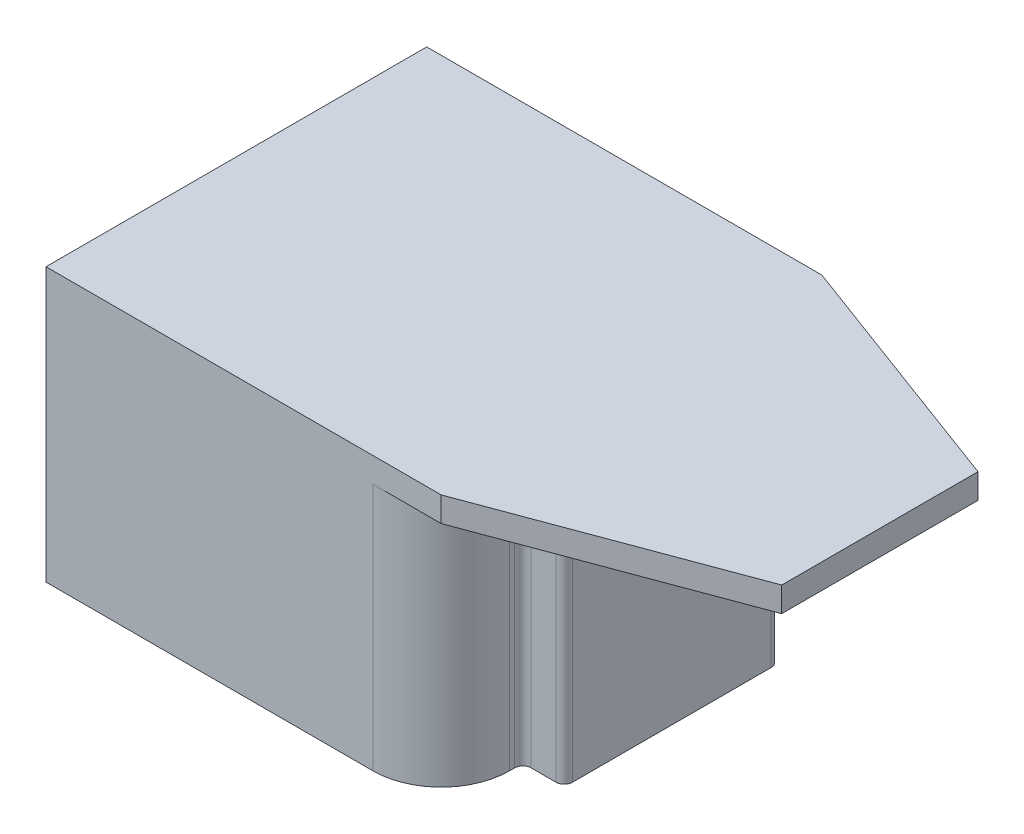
ISO-10303-21;
HEADER;
FILE_DESCRIPTION(('STEP AP214'),'2;1');
FILE_NAME('part.step','',(''),(''),'','','');
FILE_SCHEMA(('AUTOMOTIVE_DESIGN { 1 0 10303 214 1 1 1 1 }'));
ENDSEC;
DATA;
#1=APPLICATION_CONTEXT('core data for automotive mechanical design processes');
#2=APPLICATION_PROTOCOL_DEFINITION('international standard','automotive_design',2000,#1);
#3=PRODUCT_CONTEXT('',#1,'mechanical');
#4=PRODUCT('Part','Part','',(#3));
#5=PRODUCT_RELATED_PRODUCT_CATEGORY('part','',(#4));
#6=PRODUCT_DEFINITION_FORMATION('','',#4);
#7=PRODUCT_DEFINITION_CONTEXT('part definition',#1,'design');
#8=PRODUCT_DEFINITION('design','',#6,#7);
#9=PRODUCT_DEFINITION_SHAPE('','',#8);
#10=(LENGTH_UNIT() NAMED_UNIT(*) SI_UNIT(.MILLI.,.METRE.));
#11=(NAMED_UNIT(*) PLANE_ANGLE_UNIT() SI_UNIT($,.RADIAN.));
#12=(NAMED_UNIT(*) SI_UNIT($,.STERADIAN.) SOLID_ANGLE_UNIT());
#13=UNCERTAINTY_MEASURE_WITH_UNIT(LENGTH_MEASURE(1.E-05),#10,'distance_accuracy_value','');
#14=(GEOMETRIC_REPRESENTATION_CONTEXT(3) GLOBAL_UNCERTAINTY_ASSIGNED_CONTEXT((#13)) GLOBAL_UNIT_ASSIGNED_CONTEXT((#10,
#11,#12)) REPRESENTATION_CONTEXT('',''));
#15=CARTESIAN_POINT('',(0.,0.,0.));
#16=DIRECTION('',(0.,0.,1.));
#17=DIRECTION('',(1.,0.,0.));
#18=AXIS2_PLACEMENT_3D('',#15,#16,#17);
#19=CARTESIAN_POINT('',(63.9999999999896,60.,-23.7301376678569));
#20=DIRECTION('',(0.,-1.,0.));
#21=DIRECTION('',(0.,0.,-1.));
#22=AXIS2_PLACEMENT_3D('',#19,#20,#21);
#23=CYLINDRICAL_SURFACE('',#22,2.);
#24=CARTESIAN_POINT('',(63.9999999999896,0.,-23.730137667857));
#25=DIRECTION('',(0.,1.,0.));
#26=DIRECTION('',(0.,0.,1.));
#27=AXIS2_PLACEMENT_3D('',#24,#25,#26);
#28=CIRCLE('',#27,2.);
#29=CARTESIAN_POINT('',(63.9999999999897,0.,-25.7301376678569));
#30=VERTEX_POINT('',#29);
#31=CARTESIAN_POINT('',(65.9999999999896,0.,-23.730137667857));
#32=VERTEX_POINT('',#31);
#33=EDGE_CURVE('E151',#30,#32,#28,.F.);
#34=ORIENTED_EDGE('',*,*,#33,.F.);
#35=DIRECTION('',(0.,-1.,0.));
#36=VECTOR('',#35,1.);
#37=CARTESIAN_POINT('',(63.9999999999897,60.,-25.7301376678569));
#38=LINE('',#37,#36);
#39=CARTESIAN_POINT('',(63.9999999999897,60.,-25.7301376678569));
#40=VERTEX_POINT('',#39);
#41=EDGE_CURVE('E56',#40,#30,#38,.T.);
#42=ORIENTED_EDGE('',*,*,#41,.F.);
#43=CARTESIAN_POINT('',(63.9999999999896,60.,-23.7301376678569));
#44=DIRECTION('',(0.,1.,0.));
#45=DIRECTION('',(0.,0.,1.));
#46=AXIS2_PLACEMENT_3D('',#43,#44,#45);
#47=CIRCLE('',#46,2.);
#48=CARTESIAN_POINT('',(65.9999999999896,60.,-23.7301376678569));
#49=VERTEX_POINT('',#48);
#50=EDGE_CURVE('E154',#40,#49,#47,.F.);
#51=ORIENTED_EDGE('',*,*,#50,.T.);
#52=DIRECTION('',(0.,-1.,0.));
#53=VECTOR('',#52,1.);
#54=CARTESIAN_POINT('',(65.9999999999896,60.,-23.7301376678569));
#55=LINE('',#54,#53);
#56=EDGE_CURVE('E162',#49,#32,#55,.T.);
#57=ORIENTED_EDGE('',*,*,#56,.T.);
#58=EDGE_LOOP('',(#34,#42,#51,#57));
#59=FACE_BOUND('',#58,.T.);
#60=ADVANCED_FACE('F49',(#59),#23,.T.);
#61=CARTESIAN_POINT('',(0.,60.,-25.7301376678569));
#62=DIRECTION('',(0.,0.,-1.));
#63=DIRECTION('',(-1.,0.,0.));
#64=AXIS2_PLACEMENT_3D('',#61,#62,#63);
#65=PLANE('',#64);
#66=DIRECTION('',(1.,0.,0.));
#67=VECTOR('',#66,1.);
#68=CARTESIAN_POINT('',(0.,0.,-25.730137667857));
#69=LINE('',#68,#67);
#70=CARTESIAN_POINT('',(57.9999999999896,0.,-25.730137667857));
#71=VERTEX_POINT('',#70);
#72=EDGE_CURVE('E242',#71,#30,#69,.T.);
#73=ORIENTED_EDGE('',*,*,#72,.F.);
#74=DIRECTION('',(0.,-1.,0.));
#75=VECTOR('',#74,1.);
#76=CARTESIAN_POINT('',(57.9999999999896,60.,-25.7301376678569));
#77=LINE('',#76,#75);
#78=CARTESIAN_POINT('',(57.9999999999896,60.,-25.7301376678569));
#79=VERTEX_POINT('',#78);
#80=EDGE_CURVE('E233',#79,#71,#77,.T.);
#81=ORIENTED_EDGE('',*,*,#80,.F.);
#82=DIRECTION('',(1.,0.,0.));
#83=VECTOR('',#82,1.);
#84=CARTESIAN_POINT('',(0.,60.,-25.7301376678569));
#85=LINE('',#84,#83);
#86=EDGE_CURVE('E245',#79,#40,#85,.T.);
#87=ORIENTED_EDGE('',*,*,#86,.T.);
#88=ORIENTED_EDGE('',*,*,#41,.T.);
#89=EDGE_LOOP('',(#73,#81,#87,#88));
#90=FACE_BOUND('',#89,.T.);
#91=ADVANCED_FACE('F240',(#90),#65,.T.);
#92=CARTESIAN_POINT('',(57.9999999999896,60.,-27.7301376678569));
#93=DIRECTION('',(0.,-1.,0.));
#94=DIRECTION('',(0.,0.,-1.));
#95=AXIS2_PLACEMENT_3D('',#92,#93,#94);
#96=CYLINDRICAL_SURFACE('',#95,2.);
#97=CARTESIAN_POINT('',(57.9999999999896,0.,-27.730137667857));
#98=DIRECTION('',(0.,1.,0.));
#99=DIRECTION('',(0.,0.,1.));
#100=AXIS2_PLACEMENT_3D('',#97,#98,#99);
#101=CIRCLE('',#100,2.);
#102=CARTESIAN_POINT('',(55.9999999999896,0.,-27.730137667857));
#103=VERTEX_POINT('',#102);
#104=EDGE_CURVE('E251',#71,#103,#101,.F.);
#105=ORIENTED_EDGE('',*,*,#104,.T.);
#106=DIRECTION('',(0.,-1.,0.));
#107=VECTOR('',#106,1.);
#108=CARTESIAN_POINT('',(55.9999999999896,60.,-27.7301376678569));
#109=LINE('',#108,#107);
#110=CARTESIAN_POINT('',(55.9999999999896,60.,-27.7301376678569));
#111=VERTEX_POINT('',#110);
#112=EDGE_CURVE('E230',#111,#103,#109,.T.);
#113=ORIENTED_EDGE('',*,*,#112,.F.);
#114=CARTESIAN_POINT('',(57.9999999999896,60.,-27.7301376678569));
#115=DIRECTION('',(0.,1.,0.));
#116=DIRECTION('',(0.,0.,1.));
#117=AXIS2_PLACEMENT_3D('',#114,#115,#116);
#118=CIRCLE('',#117,2.);
#119=EDGE_CURVE('E519',#79,#111,#118,.F.);
#120=ORIENTED_EDGE('',*,*,#119,.F.);
#121=ORIENTED_EDGE('',*,*,#80,.T.);
#122=EDGE_LOOP('',(#105,#113,#120,#121));
#123=FACE_BOUND('',#122,.T.);
#124=ADVANCED_FACE('F584',(#123),#96,.F.);
#125=CARTESIAN_POINT('',(55.9999999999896,60.,0.));
#126=DIRECTION('',(1.,0.,0.));
#127=DIRECTION('',(0.,0.,-1.));
#128=AXIS2_PLACEMENT_3D('',#125,#126,#127);
#129=PLANE('',#128);
#130=DIRECTION('',(0.,0.,1.));
#131=VECTOR('',#130,1.);
#132=CARTESIAN_POINT('',(55.9999999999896,0.,0.));
#133=LINE('',#132,#131);
#134=CARTESIAN_POINT('',(55.9999999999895,0.,-28.823337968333));
#135=VERTEX_POINT('',#134);
#136=EDGE_CURVE('E261',#135,#103,#133,.T.);
#137=ORIENTED_EDGE('',*,*,#136,.F.);
#138=DIRECTION('',(0.,-1.,0.));
#139=VECTOR('',#138,1.);
#140=CARTESIAN_POINT('',(55.9999999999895,60.,-28.823337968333));
#141=LINE('',#140,#139);
#142=CARTESIAN_POINT('',(55.9999999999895,60.,-28.823337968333));
#143=VERTEX_POINT('',#142);
#144=EDGE_CURVE('E227',#143,#135,#141,.T.);
#145=ORIENTED_EDGE('',*,*,#144,.F.);
#146=DIRECTION('',(0.,0.,1.));
#147=VECTOR('',#146,1.);
#148=CARTESIAN_POINT('',(55.9999999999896,60.,0.));
#149=LINE('',#148,#147);
#150=EDGE_CURVE('E522',#143,#111,#149,.T.);
#151=ORIENTED_EDGE('',*,*,#150,.T.);
#152=ORIENTED_EDGE('',*,*,#112,.T.);
#153=EDGE_LOOP('',(#137,#145,#151,#152));
#154=FACE_BOUND('',#153,.T.);
#155=ADVANCED_FACE('F588',(#154),#129,.T.);
#156=CARTESIAN_POINT('',(39.5138807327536,60.,-29.5000000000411));
#157=DIRECTION('',(0.,-1.,0.));
#158=DIRECTION('',(0.,0.,-1.));
#159=AXIS2_PLACEMENT_3D('',#156,#157,#158);
#160=CYLINDRICAL_SURFACE('',#159,16.4999999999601);
#161=CARTESIAN_POINT('',(39.5138807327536,0.,-29.5000000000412));
#162=DIRECTION('',(0.,1.,0.));
#163=DIRECTION('',(0.,0.,1.));
#164=AXIS2_PLACEMENT_3D('',#161,#162,#163);
#165=CIRCLE('',#164,16.4999999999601);
#166=CARTESIAN_POINT('',(39.5138807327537,0.,-46.0000000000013));
#167=VERTEX_POINT('',#166);
#168=EDGE_CURVE('E263',#135,#167,#165,.T.);
#169=ORIENTED_EDGE('',*,*,#168,.T.);
#170=DIRECTION('',(0.,-1.,0.));
#171=VECTOR('',#170,1.);
#172=CARTESIAN_POINT('',(39.5138807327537,59.9999999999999,-46.0000000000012));
#173=LINE('',#172,#171);
#174=CARTESIAN_POINT('',(39.5138807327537,59.9999999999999,-46.0000000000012));
#175=VERTEX_POINT('',#174);
#176=EDGE_CURVE('E224',#175,#167,#173,.T.);
#177=ORIENTED_EDGE('',*,*,#176,.F.);
#178=CARTESIAN_POINT('',(39.5138807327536,60.,-29.5000000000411));
#179=DIRECTION('',(0.,1.,0.));
#180=DIRECTION('',(0.,0.,1.));
#181=AXIS2_PLACEMENT_3D('',#178,#179,#180);
#182=CIRCLE('',#181,16.4999999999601);
#183=EDGE_CURVE('E447',#143,#175,#182,.T.);
#184=ORIENTED_EDGE('',*,*,#183,.F.);
#185=ORIENTED_EDGE('',*,*,#144,.T.);
#186=EDGE_LOOP('',(#169,#177,#184,#185));
#187=FACE_BOUND('',#186,.T.);
#188=ADVANCED_FACE('F530',(#187),#160,.T.);
#189=CARTESIAN_POINT('',(0.,59.9999999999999,-46.0000000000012));
#190=DIRECTION('',(0.,0.,-1.));
#191=DIRECTION('',(-1.,0.,0.));
#192=AXIS2_PLACEMENT_3D('',#189,#190,#191);
#193=PLANE('',#192);
#194=DIRECTION('',(1.,0.,0.));
#195=VECTOR('',#194,1.);
#196=CARTESIAN_POINT('',(0.,0.,-46.0000000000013));
#197=LINE('',#196,#195);
#198=CARTESIAN_POINT('',(-39.500000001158,0.,-46.0000000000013));
#199=VERTEX_POINT('',#198);
#200=EDGE_CURVE('E266',#199,#167,#197,.T.);
#201=ORIENTED_EDGE('',*,*,#200,.F.);
#202=DIRECTION('',(0.,-1.,0.));
#203=VECTOR('',#202,1.);
#204=CARTESIAN_POINT('',(-39.500000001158,59.9999999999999,-46.0000000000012));
#205=LINE('',#204,#203);
#206=CARTESIAN_POINT('',(-39.500000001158,66.,-46.0000000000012));
#207=VERTEX_POINT('',#206);
#208=EDGE_CURVE('E221',#207,#199,#205,.T.);
#209=ORIENTED_EDGE('',*,*,#208,.F.);
#210=DIRECTION('',(-1.,0.,0.));
#211=VECTOR('',#210,1.);
#212=CARTESIAN_POINT('',(0.,66.,-46.0000000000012));
#213=LINE('',#212,#211);
#214=CARTESIAN_POINT('',(55.9999999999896,66.,-46.0000000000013));
#215=VERTEX_POINT('',#214);
#216=EDGE_CURVE('E486',#215,#207,#213,.T.);
#217=ORIENTED_EDGE('',*,*,#216,.F.);
#218=DIRECTION('',(0.,-1.,0.));
#219=VECTOR('',#218,1.);
#220=CARTESIAN_POINT('',(55.9999999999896,66.,-46.0000000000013));
#221=LINE('',#220,#219);
#222=CARTESIAN_POINT('',(55.9999999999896,59.9999999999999,-46.0000000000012));
#223=VERTEX_POINT('',#222);
#224=EDGE_CURVE('E249',#215,#223,#221,.T.);
#225=ORIENTED_EDGE('',*,*,#224,.T.);
#226=DIRECTION('',(-1.,0.,0.));
#227=VECTOR('',#226,1.);
#228=CARTESIAN_POINT('',(0.,59.9999999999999,-46.0000000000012));
#229=LINE('',#228,#227);
#230=EDGE_CURVE('E476',#223,#175,#229,.T.);
#231=ORIENTED_EDGE('',*,*,#230,.T.);
#232=ORIENTED_EDGE('',*,*,#176,.T.);
#233=EDGE_LOOP('',(#201,#209,#217,#225,#231,#232));
#234=FACE_BOUND('',#233,.T.);
#235=ADVANCED_FACE('F533',(#234),#193,.T.);
#236=CARTESIAN_POINT('',(0.,59.9999999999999,-40.0000000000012));
#237=DIRECTION('',(0.,0.,-1.));
#238=DIRECTION('',(-1.,0.,0.));
#239=AXIS2_PLACEMENT_3D('',#236,#237,#238);
#240=PLANE('',#239);
#241=DIRECTION('',(1.,0.,0.));
#242=VECTOR('',#241,1.);
#243=CARTESIAN_POINT('',(0.,0.,-40.0000000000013));
#244=LINE('',#243,#242);
#245=CARTESIAN_POINT('',(-39.500000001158,0.,-40.0000000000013));
#246=VERTEX_POINT('',#245);
#247=CARTESIAN_POINT('',(39.5138807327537,0.,-40.0000000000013));
#248=VERTEX_POINT('',#247);
#249=EDGE_CURVE('E270',#246,#248,#244,.T.);
#250=ORIENTED_EDGE('',*,*,#249,.T.);
#251=DIRECTION('',(0.,-1.,0.));
#252=VECTOR('',#251,1.);
#253=CARTESIAN_POINT('',(39.5138807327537,59.9999999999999,-40.0000000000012));
#254=LINE('',#253,#252);
#255=CARTESIAN_POINT('',(39.5138807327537,59.9999999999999,-40.0000000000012));
#256=VERTEX_POINT('',#255);
#257=EDGE_CURVE('E215',#256,#248,#254,.T.);
#258=ORIENTED_EDGE('',*,*,#257,.F.);
#259=DIRECTION('',(1.,0.,0.));
#260=VECTOR('',#259,1.);
#261=CARTESIAN_POINT('',(0.,59.9999999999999,-40.0000000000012));
#262=LINE('',#261,#260);
#263=CARTESIAN_POINT('',(-39.500000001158,59.9999999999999,-40.0000000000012));
#264=VERTEX_POINT('',#263);
#265=EDGE_CURVE('E406',#264,#256,#262,.T.);
#266=ORIENTED_EDGE('',*,*,#265,.F.);
#267=DIRECTION('',(0.,-1.,0.));
#268=VECTOR('',#267,1.);
#269=CARTESIAN_POINT('',(-39.500000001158,59.9999999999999,-40.0000000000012));
#270=LINE('',#269,#268);
#271=EDGE_CURVE('E218',#264,#246,#270,.T.);
#272=ORIENTED_EDGE('',*,*,#271,.T.);
#273=EDGE_LOOP('',(#250,#258,#266,#272));
#274=FACE_BOUND('',#273,.T.);
#275=ADVANCED_FACE('F404',(#274),#240,.F.);
#276=CARTESIAN_POINT('',(39.5138807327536,60.,-29.5000000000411));
#277=DIRECTION('',(0.,-1.,0.));
#278=DIRECTION('',(0.,0.,-1.));
#279=AXIS2_PLACEMENT_3D('',#276,#277,#278);
#280=CYLINDRICAL_SURFACE('',#279,10.4999999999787);
#281=CARTESIAN_POINT('',(39.5138807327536,0.,-29.5000000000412));
#282=DIRECTION('',(0.,1.,0.));
#283=DIRECTION('',(0.,0.,1.));
#284=AXIS2_PLACEMENT_3D('',#281,#282,#283);
#285=CIRCLE('',#284,10.4999999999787);
#286=CARTESIAN_POINT('',(49.9999999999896,0.,-28.9602753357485));
#287=VERTEX_POINT('',#286);
#288=EDGE_CURVE('E273',#287,#248,#285,.T.);
#289=ORIENTED_EDGE('',*,*,#288,.F.);
#290=DIRECTION('',(0.,-1.,0.));
#291=VECTOR('',#290,1.);
#292=CARTESIAN_POINT('',(49.9999999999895,60.,-28.9602753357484));
#293=LINE('',#292,#291);
#294=CARTESIAN_POINT('',(49.9999999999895,60.,-28.9602753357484));
#295=VERTEX_POINT('',#294);
#296=EDGE_CURVE('E212',#295,#287,#293,.T.);
#297=ORIENTED_EDGE('',*,*,#296,.F.);
#298=CARTESIAN_POINT('',(39.5138807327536,60.,-29.5000000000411));
#299=DIRECTION('',(0.,1.,0.));
#300=DIRECTION('',(0.,0.,1.));
#301=AXIS2_PLACEMENT_3D('',#298,#299,#300);
#302=CIRCLE('',#301,10.4999999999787);
#303=EDGE_CURVE('E400',#295,#256,#302,.T.);
#304=ORIENTED_EDGE('',*,*,#303,.T.);
#305=ORIENTED_EDGE('',*,*,#257,.T.);
#306=EDGE_LOOP('',(#289,#297,#304,#305));
#307=FACE_BOUND('',#306,.T.);
#308=ADVANCED_FACE('F398',(#307),#280,.F.);
#309=CARTESIAN_POINT('',(49.9999999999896,60.,1.11022302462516E-13));
#310=DIRECTION('',(-1.,0.,0.));
#311=DIRECTION('',(0.,0.,1.));
#312=AXIS2_PLACEMENT_3D('',#309,#310,#311);
#313=PLANE('',#312);
#314=DIRECTION('',(0.,0.,-1.));
#315=VECTOR('',#314,1.);
#316=CARTESIAN_POINT('',(49.9999999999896,0.,0.));
#317=LINE('',#316,#315);
#318=CARTESIAN_POINT('',(49.9999999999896,0.,-19.730137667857));
#319=VERTEX_POINT('',#318);
#320=EDGE_CURVE('E275',#319,#287,#317,.T.);
#321=ORIENTED_EDGE('',*,*,#320,.F.);
#322=DIRECTION('',(0.,-1.,0.));
#323=VECTOR('',#322,1.);
#324=CARTESIAN_POINT('',(49.9999999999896,60.,-19.7301376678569));
#325=LINE('',#324,#323);
#326=CARTESIAN_POINT('',(49.9999999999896,60.,-19.7301376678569));
#327=VERTEX_POINT('',#326);
#328=EDGE_CURVE('E209',#327,#319,#325,.T.);
#329=ORIENTED_EDGE('',*,*,#328,.F.);
#330=DIRECTION('',(0.,0.,-1.));
#331=VECTOR('',#330,1.);
#332=CARTESIAN_POINT('',(49.9999999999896,60.,1.11022302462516E-13));
#333=LINE('',#332,#331);
#334=EDGE_CURVE('E443',#327,#295,#333,.T.);
#335=ORIENTED_EDGE('',*,*,#334,.T.);
#336=ORIENTED_EDGE('',*,*,#296,.T.);
#337=EDGE_LOOP('',(#321,#329,#335,#336));
#338=FACE_BOUND('',#337,.T.);
#339=ADVANCED_FACE('F391',(#338),#313,.T.);
#340=CARTESIAN_POINT('',(0.,60.,-19.7301376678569));
#341=DIRECTION('',(0.,0.,1.));
#342=DIRECTION('',(1.,0.,0.));
#343=AXIS2_PLACEMENT_3D('',#340,#341,#342);
#344=PLANE('',#343);
#345=DIRECTION('',(-1.,0.,0.));
#346=VECTOR('',#345,1.);
#347=CARTESIAN_POINT('',(0.,0.,-19.730137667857));
#348=LINE('',#347,#346);
#349=CARTESIAN_POINT('',(59.9999999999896,0.,-19.730137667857));
#350=VERTEX_POINT('',#349);
#351=EDGE_CURVE('E277',#350,#319,#348,.T.);
#352=ORIENTED_EDGE('',*,*,#351,.F.);
#353=DIRECTION('',(0.,-1.,0.));
#354=VECTOR('',#353,1.);
#355=CARTESIAN_POINT('',(59.9999999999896,60.,-19.730137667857));
#356=LINE('',#355,#354);
#357=CARTESIAN_POINT('',(59.9999999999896,50.,-19.7301376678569));
#358=VERTEX_POINT('',#357);
#359=EDGE_CURVE('E206',#358,#350,#356,.T.);
#360=ORIENTED_EDGE('',*,*,#359,.F.);
#361=DIRECTION('',(-1.,0.,0.));
#362=VECTOR('',#361,1.);
#363=CARTESIAN_POINT('',(115.99999999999,50.,-19.730137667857));
#364=LINE('',#363,#362);
#365=CARTESIAN_POINT('',(65.9999999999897,50.,-19.7301376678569));
#366=VERTEX_POINT('',#365);
#367=EDGE_CURVE('E471',#366,#358,#364,.T.);
#368=ORIENTED_EDGE('',*,*,#367,.F.);
#369=DIRECTION('',(0.,1.,0.));
#370=VECTOR('',#369,1.);
#371=CARTESIAN_POINT('',(65.9999999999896,60.,-19.730137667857));
#372=LINE('',#371,#370);
#373=CARTESIAN_POINT('',(65.9999999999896,60.,-19.730137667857));
#374=VERTEX_POINT('',#373);
#375=EDGE_CURVE('E468',#366,#374,#372,.T.);
#376=ORIENTED_EDGE('',*,*,#375,.T.);
#377=DIRECTION('',(-1.,0.,0.));
#378=VECTOR('',#377,1.);
#379=CARTESIAN_POINT('',(0.,60.,-19.7301376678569));
#380=LINE('',#379,#378);
#381=EDGE_CURVE('E387',#374,#327,#380,.T.);
#382=ORIENTED_EDGE('',*,*,#381,.T.);
#383=ORIENTED_EDGE('',*,*,#328,.T.);
#384=EDGE_LOOP('',(#352,#360,#368,#376,#382,#383));
#385=FACE_BOUND('',#384,.T.);
#386=ADVANCED_FACE('F380',(#385),#344,.T.);
#387=CARTESIAN_POINT('',(59.9999999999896,60.,0.));
#388=DIRECTION('',(-1.,0.,0.));
#389=DIRECTION('',(0.,0.,1.));
#390=AXIS2_PLACEMENT_3D('',#387,#388,#389);
#391=PLANE('',#390);
#392=DIRECTION('',(0.,0.,1.));
#393=VECTOR('',#392,1.);
#394=CARTESIAN_POINT('',(59.9999999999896,50.,-19.7301376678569));
#395=LINE('',#394,#393);
#396=CARTESIAN_POINT('',(59.9999999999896,50.,20.2698623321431));
#397=VERTEX_POINT('',#396);
#398=EDGE_CURVE('E376',#358,#397,#395,.T.);
#399=ORIENTED_EDGE('',*,*,#398,.F.);
#400=ORIENTED_EDGE('',*,*,#359,.T.);
#401=DIRECTION('',(0.,0.,-1.));
#402=VECTOR('',#401,1.);
#403=CARTESIAN_POINT('',(59.9999999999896,0.,0.));
#404=LINE('',#403,#402);
#405=CARTESIAN_POINT('',(59.9999999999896,0.,20.269862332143));
#406=VERTEX_POINT('',#405);
#407=EDGE_CURVE('E279',#406,#350,#404,.T.);
#408=ORIENTED_EDGE('',*,*,#407,.F.);
#409=DIRECTION('',(0.,-1.,0.));
#410=VECTOR('',#409,1.);
#411=CARTESIAN_POINT('',(59.9999999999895,60.,20.2698623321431));
#412=LINE('',#411,#410);
#413=EDGE_CURVE('E203',#397,#406,#412,.T.);
#414=ORIENTED_EDGE('',*,*,#413,.F.);
#415=EDGE_LOOP('',(#399,#400,#408,#414));
#416=FACE_BOUND('',#415,.T.);
#417=ADVANCED_FACE('F373',(#416),#391,.T.);
#418=CARTESIAN_POINT('',(0.,60.,20.2698623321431));
#419=DIRECTION('',(0.,0.,-1.));
#420=DIRECTION('',(-1.,0.,0.));
#421=AXIS2_PLACEMENT_3D('',#418,#419,#420);
#422=PLANE('',#421);
#423=DIRECTION('',(1.,0.,0.));
#424=VECTOR('',#423,1.);
#425=CARTESIAN_POINT('',(0.,0.,20.269862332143));
#426=LINE('',#425,#424);
#427=CARTESIAN_POINT('',(49.9999999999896,0.,20.269862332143));
#428=VERTEX_POINT('',#427);
#429=EDGE_CURVE('E281',#428,#406,#426,.T.);
#430=ORIENTED_EDGE('',*,*,#429,.F.);
#431=DIRECTION('',(0.,-1.,0.));
#432=VECTOR('',#431,1.);
#433=CARTESIAN_POINT('',(49.9999999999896,60.,20.2698623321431));
#434=LINE('',#433,#432);
#435=CARTESIAN_POINT('',(49.9999999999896,60.,20.2698623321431));
#436=VERTEX_POINT('',#435);
#437=EDGE_CURVE('E200',#436,#428,#434,.T.);
#438=ORIENTED_EDGE('',*,*,#437,.F.);
#439=DIRECTION('',(1.,0.,0.));
#440=VECTOR('',#439,1.);
#441=CARTESIAN_POINT('',(0.,60.,20.2698623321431));
#442=LINE('',#441,#440);
#443=CARTESIAN_POINT('',(65.9999999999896,60.,20.2698623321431));
#444=VERTEX_POINT('',#443);
#445=EDGE_CURVE('E452',#436,#444,#442,.T.);
#446=ORIENTED_EDGE('',*,*,#445,.T.);
#447=DIRECTION('',(0.,-1.,0.));
#448=VECTOR('',#447,1.);
#449=CARTESIAN_POINT('',(65.9999999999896,60.,20.2698623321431));
#450=LINE('',#449,#448);
#451=CARTESIAN_POINT('',(65.9999999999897,50.,20.2698623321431));
#452=VERTEX_POINT('',#451);
#453=EDGE_CURVE('E473',#444,#452,#450,.T.);
#454=ORIENTED_EDGE('',*,*,#453,.T.);
#455=DIRECTION('',(-1.,0.,0.));
#456=VECTOR('',#455,1.);
#457=CARTESIAN_POINT('',(115.99999999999,50.,20.269862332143));
#458=LINE('',#457,#456);
#459=EDGE_CURVE('E479',#452,#397,#458,.T.);
#460=ORIENTED_EDGE('',*,*,#459,.T.);
#461=ORIENTED_EDGE('',*,*,#413,.T.);
#462=EDGE_LOOP('',(#430,#438,#446,#454,#460,#461));
#463=FACE_BOUND('',#462,.T.);
#464=ADVANCED_FACE('F365',(#463),#422,.T.);
#465=CARTESIAN_POINT('',(49.9999999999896,60.,0.));
#466=DIRECTION('',(-1.,0.,0.));
#467=DIRECTION('',(0.,0.,1.));
#468=AXIS2_PLACEMENT_3D('',#465,#466,#467);
#469=PLANE('',#468);
#470=DIRECTION('',(0.,0.,-1.));
#471=VECTOR('',#470,1.);
#472=CARTESIAN_POINT('',(49.9999999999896,0.,0.));
#473=LINE('',#472,#471);
#474=CARTESIAN_POINT('',(49.9999999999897,0.,29.5000000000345));
#475=VERTEX_POINT('',#474);
#476=EDGE_CURVE('E283',#475,#428,#473,.T.);
#477=ORIENTED_EDGE('',*,*,#476,.F.);
#478=DIRECTION('',(0.,-1.,0.));
#479=VECTOR('',#478,1.);
#480=CARTESIAN_POINT('',(49.9999999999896,60.0000000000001,29.5000000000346));
#481=LINE('',#480,#479);
#482=CARTESIAN_POINT('',(49.9999999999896,60.0000000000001,29.5000000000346));
#483=VERTEX_POINT('',#482);
#484=EDGE_CURVE('E197',#483,#475,#481,.T.);
#485=ORIENTED_EDGE('',*,*,#484,.F.);
#486=DIRECTION('',(0.,0.,-1.));
#487=VECTOR('',#486,1.);
#488=CARTESIAN_POINT('',(49.9999999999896,60.,0.));
#489=LINE('',#488,#487);
#490=EDGE_CURVE('E361',#483,#436,#489,.T.);
#491=ORIENTED_EDGE('',*,*,#490,.T.);
#492=ORIENTED_EDGE('',*,*,#437,.T.);
#493=EDGE_LOOP('',(#477,#485,#491,#492));
#494=FACE_BOUND('',#493,.T.);
#495=ADVANCED_FACE('F357',(#494),#469,.T.);
#496=CARTESIAN_POINT('',(39.4999999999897,60.,29.5000000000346));
#497=DIRECTION('',(0.,-1.,0.));
#498=DIRECTION('',(0.,0.,-1.));
#499=AXIS2_PLACEMENT_3D('',#496,#497,#498);
#500=CYLINDRICAL_SURFACE('',#499,10.4999999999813);
#501=CARTESIAN_POINT('',(39.4999999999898,0.,29.5000000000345));
#502=DIRECTION('',(0.,1.,0.));
#503=DIRECTION('',(0.,0.,1.));
#504=AXIS2_PLACEMENT_3D('',#501,#502,#503);
#505=CIRCLE('',#504,10.4999999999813);
#506=CARTESIAN_POINT('',(39.4999999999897,0.,39.9999999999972));
#507=VERTEX_POINT('',#506);
#508=EDGE_CURVE('E285',#475,#507,#505,.F.);
#509=ORIENTED_EDGE('',*,*,#508,.T.);
#510=DIRECTION('',(0.,-1.,0.));
#511=VECTOR('',#510,1.);
#512=CARTESIAN_POINT('',(39.4999999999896,60.0000000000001,39.9999999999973));
#513=LINE('',#512,#511);
#514=CARTESIAN_POINT('',(39.4999999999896,60.0000000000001,39.9999999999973));
#515=VERTEX_POINT('',#514);
#516=EDGE_CURVE('E194',#515,#507,#513,.T.);
#517=ORIENTED_EDGE('',*,*,#516,.F.);
#518=CARTESIAN_POINT('',(39.4999999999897,60.,29.5000000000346));
#519=DIRECTION('',(0.,1.,0.));
#520=DIRECTION('',(0.,0.,1.));
#521=AXIS2_PLACEMENT_3D('',#518,#519,#520);
#522=CIRCLE('',#521,10.4999999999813);
#523=EDGE_CURVE('E353',#483,#515,#522,.F.);
#524=ORIENTED_EDGE('',*,*,#523,.F.);
#525=ORIENTED_EDGE('',*,*,#484,.T.);
#526=EDGE_LOOP('',(#509,#517,#524,#525));
#527=FACE_BOUND('',#526,.T.);
#528=ADVANCED_FACE('F350',(#527),#500,.F.);
#529=CARTESIAN_POINT('',(0.,60.0000000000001,39.9999999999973));
#530=DIRECTION('',(0.,0.,1.));
#531=DIRECTION('',(1.,0.,0.));
#532=AXIS2_PLACEMENT_3D('',#529,#530,#531);
#533=PLANE('',#532);
#534=DIRECTION('',(-1.,0.,0.));
#535=VECTOR('',#534,1.);
#536=CARTESIAN_POINT('',(0.,0.,39.9999999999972));
#537=LINE('',#536,#535);
#538=CARTESIAN_POINT('',(-39.5000000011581,0.,39.9999999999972));
#539=VERTEX_POINT('',#538);
#540=EDGE_CURVE('E288',#507,#539,#537,.T.);
#541=ORIENTED_EDGE('',*,*,#540,.T.);
#542=DIRECTION('',(0.,-1.,0.));
#543=VECTOR('',#542,1.);
#544=CARTESIAN_POINT('',(-39.5000000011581,60.0000000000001,39.9999999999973));
#545=LINE('',#544,#543);
#546=CARTESIAN_POINT('',(-39.5000000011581,60.0000000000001,39.9999999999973));
#547=VERTEX_POINT('',#546);
#548=EDGE_CURVE('E191',#547,#539,#545,.T.);
#549=ORIENTED_EDGE('',*,*,#548,.F.);
#550=DIRECTION('',(-1.,0.,0.));
#551=VECTOR('',#550,1.);
#552=CARTESIAN_POINT('',(0.,60.0000000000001,39.9999999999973));
#553=LINE('',#552,#551);
#554=EDGE_CURVE('E456',#515,#547,#553,.T.);
#555=ORIENTED_EDGE('',*,*,#554,.F.);
#556=ORIENTED_EDGE('',*,*,#516,.T.);
#557=EDGE_LOOP('',(#541,#549,#555,#556));
#558=FACE_BOUND('',#557,.T.);
#559=ADVANCED_FACE('F344',(#558),#533,.F.);
#560=CARTESIAN_POINT('',(-39.5000000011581,60.,1.11022302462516E-13));
#561=DIRECTION('',(-1.,0.,0.));
#562=DIRECTION('',(0.,0.,1.));
#563=AXIS2_PLACEMENT_3D('',#560,#561,#562);
#564=PLANE('',#563);
#565=DIRECTION('',(0.,0.,-1.));
#566=VECTOR('',#565,1.);
#567=CARTESIAN_POINT('',(-39.5000000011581,0.,0.));
#568=LINE('',#567,#566);
#569=CARTESIAN_POINT('',(-39.5000000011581,0.,45.9999999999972));
#570=VERTEX_POINT('',#569);
#571=EDGE_CURVE('E291',#570,#539,#568,.T.);
#572=ORIENTED_EDGE('',*,*,#571,.F.);
#573=DIRECTION('',(0.,-1.,0.));
#574=VECTOR('',#573,1.);
#575=CARTESIAN_POINT('',(-39.5000000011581,60.0000000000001,45.9999999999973));
#576=LINE('',#575,#574);
#577=CARTESIAN_POINT('',(-39.5000000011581,66.0000000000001,45.9999999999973));
#578=VERTEX_POINT('',#577);
#579=EDGE_CURVE('E188',#578,#570,#576,.T.);
#580=ORIENTED_EDGE('',*,*,#579,.F.);
#581=DIRECTION('',(0.,0.,1.));
#582=VECTOR('',#581,1.);
#583=CARTESIAN_POINT('',(-39.5000000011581,66.,0.));
#584=LINE('',#583,#582);
#585=EDGE_CURVE('E490',#207,#578,#584,.T.);
#586=ORIENTED_EDGE('',*,*,#585,.F.);
#587=ORIENTED_EDGE('',*,*,#208,.T.);
#588=DIRECTION('',(0.,0.,-1.));
#589=VECTOR('',#588,1.);
#590=CARTESIAN_POINT('',(-39.5000000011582,0.,-1.38777878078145E-13));
#591=LINE('',#590,#589);
#592=EDGE_CURVE('E268',#246,#199,#591,.T.);
#593=ORIENTED_EDGE('',*,*,#592,.F.);
#594=ORIENTED_EDGE('',*,*,#271,.F.);
#595=DIRECTION('',(0.,0.,1.));
#596=VECTOR('',#595,1.);
#597=CARTESIAN_POINT('',(-39.5000000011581,60.,0.));
#598=LINE('',#597,#596);
#599=EDGE_CURVE('E340',#264,#547,#598,.T.);
#600=ORIENTED_EDGE('',*,*,#599,.T.);
#601=ORIENTED_EDGE('',*,*,#548,.T.);
#602=EDGE_LOOP('',(#572,#580,#586,#587,#593,#594,#600,#601));
#603=FACE_BOUND('',#602,.T.);
#604=ADVANCED_FACE('F334',(#603),#564,.T.);
#605=CARTESIAN_POINT('',(0.,60.0000000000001,45.9999999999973));
#606=DIRECTION('',(0.,0.,1.));
#607=DIRECTION('',(1.,0.,0.));
#608=AXIS2_PLACEMENT_3D('',#605,#606,#607);
#609=PLANE('',#608);
#610=DIRECTION('',(-1.,0.,0.));
#611=VECTOR('',#610,1.);
#612=CARTESIAN_POINT('',(0.,0.,45.9999999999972));
#613=LINE('',#612,#611);
#614=CARTESIAN_POINT('',(39.4999999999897,0.,45.9999999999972));
#615=VERTEX_POINT('',#614);
#616=EDGE_CURVE('E293',#615,#570,#613,.T.);
#617=ORIENTED_EDGE('',*,*,#616,.F.);
#618=DIRECTION('',(0.,-1.,0.));
#619=VECTOR('',#618,1.);
#620=CARTESIAN_POINT('',(39.4999999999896,60.0000000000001,45.9999999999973));
#621=LINE('',#620,#619);
#622=CARTESIAN_POINT('',(39.4999999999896,60.0000000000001,45.9999999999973));
#623=VERTEX_POINT('',#622);
#624=EDGE_CURVE('E185',#623,#615,#621,.T.);
#625=ORIENTED_EDGE('',*,*,#624,.F.);
#626=DIRECTION('',(1.,0.,0.));
#627=VECTOR('',#626,1.);
#628=CARTESIAN_POINT('',(0.,60.0000000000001,45.9999999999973));
#629=LINE('',#628,#627);
#630=CARTESIAN_POINT('',(55.9999999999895,60.0000000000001,45.9999999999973));
#631=VERTEX_POINT('',#630);
#632=EDGE_CURVE('E502',#623,#631,#629,.T.);
#633=ORIENTED_EDGE('',*,*,#632,.T.);
#634=DIRECTION('',(0.,-1.,0.));
#635=VECTOR('',#634,1.);
#636=CARTESIAN_POINT('',(55.9999999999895,66.0000000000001,45.9999999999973));
#637=LINE('',#636,#635);
#638=CARTESIAN_POINT('',(55.9999999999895,66.0000000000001,45.9999999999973));
#639=VERTEX_POINT('',#638);
#640=EDGE_CURVE('E254',#639,#631,#637,.T.);
#641=ORIENTED_EDGE('',*,*,#640,.F.);
#642=DIRECTION('',(1.,0.,0.));
#643=VECTOR('',#642,1.);
#644=CARTESIAN_POINT('',(0.,66.0000000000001,45.9999999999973));
#645=LINE('',#644,#643);
#646=EDGE_CURVE('E330',#578,#639,#645,.T.);
#647=ORIENTED_EDGE('',*,*,#646,.F.);
#648=ORIENTED_EDGE('',*,*,#579,.T.);
#649=EDGE_LOOP('',(#617,#625,#633,#641,#647,#648));
#650=FACE_BOUND('',#649,.T.);
#651=ADVANCED_FACE('F326',(#650),#609,.T.);
#652=CARTESIAN_POINT('',(39.4999999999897,60.,29.5000000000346));
#653=DIRECTION('',(0.,-1.,0.));
#654=DIRECTION('',(0.,0.,-1.));
#655=AXIS2_PLACEMENT_3D('',#652,#653,#654);
#656=CYLINDRICAL_SURFACE('',#655,16.4999999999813);
#657=CARTESIAN_POINT('',(39.4999999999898,0.,29.5000000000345));
#658=DIRECTION('',(0.,1.,0.));
#659=DIRECTION('',(0.,0.,1.));
#660=AXIS2_PLACEMENT_3D('',#657,#658,#659);
#661=CIRCLE('',#660,16.4999999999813);
#662=CARTESIAN_POINT('',(55.9999999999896,0.,29.5000000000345));
#663=VERTEX_POINT('',#662);
#664=EDGE_CURVE('E295',#615,#663,#661,.T.);
#665=ORIENTED_EDGE('',*,*,#664,.T.);
#666=DIRECTION('',(0.,-1.,0.));
#667=VECTOR('',#666,1.);
#668=CARTESIAN_POINT('',(55.9999999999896,60.0000000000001,29.5000000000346));
#669=LINE('',#668,#667);
#670=CARTESIAN_POINT('',(55.9999999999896,60.0000000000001,29.5000000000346));
#671=VERTEX_POINT('',#670);
#672=EDGE_CURVE('E182',#671,#663,#669,.T.);
#673=ORIENTED_EDGE('',*,*,#672,.F.);
#674=CARTESIAN_POINT('',(39.4999999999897,60.,29.5000000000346));
#675=DIRECTION('',(0.,1.,0.));
#676=DIRECTION('',(0.,0.,1.));
#677=AXIS2_PLACEMENT_3D('',#674,#675,#676);
#678=CIRCLE('',#677,16.4999999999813);
#679=EDGE_CURVE('E458',#623,#671,#678,.T.);
#680=ORIENTED_EDGE('',*,*,#679,.F.);
#681=ORIENTED_EDGE('',*,*,#624,.T.);
#682=EDGE_LOOP('',(#665,#673,#680,#681));
#683=FACE_BOUND('',#682,.T.);
#684=ADVANCED_FACE('F319',(#683),#656,.T.);
#685=CARTESIAN_POINT('',(55.9999999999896,60.,0.));
#686=DIRECTION('',(1.,0.,0.));
#687=DIRECTION('',(0.,0.,-1.));
#688=AXIS2_PLACEMENT_3D('',#685,#686,#687);
#689=PLANE('',#688);
#690=DIRECTION('',(0.,0.,1.));
#691=VECTOR('',#690,1.);
#692=CARTESIAN_POINT('',(55.9999999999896,0.,0.));
#693=LINE('',#692,#691);
#694=CARTESIAN_POINT('',(55.9999999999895,0.,28.269862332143));
#695=VERTEX_POINT('',#694);
#696=EDGE_CURVE('E298',#695,#663,#693,.T.);
#697=ORIENTED_EDGE('',*,*,#696,.F.);
#698=DIRECTION('',(0.,-1.,0.));
#699=VECTOR('',#698,1.);
#700=CARTESIAN_POINT('',(55.9999999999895,60.,28.269862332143));
#701=LINE('',#700,#699);
#702=CARTESIAN_POINT('',(55.9999999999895,60.,28.269862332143));
#703=VERTEX_POINT('',#702);
#704=EDGE_CURVE('E179',#703,#695,#701,.T.);
#705=ORIENTED_EDGE('',*,*,#704,.F.);
#706=DIRECTION('',(0.,0.,1.));
#707=VECTOR('',#706,1.);
#708=CARTESIAN_POINT('',(55.9999999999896,60.,0.));
#709=LINE('',#708,#707);
#710=EDGE_CURVE('E315',#703,#671,#709,.T.);
#711=ORIENTED_EDGE('',*,*,#710,.T.);
#712=ORIENTED_EDGE('',*,*,#672,.T.);
#713=EDGE_LOOP('',(#697,#705,#711,#712));
#714=FACE_BOUND('',#713,.T.);
#715=ADVANCED_FACE('F312',(#714),#689,.T.);
#716=CARTESIAN_POINT('',(57.9999999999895,60.,28.269862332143));
#717=DIRECTION('',(0.,-1.,0.));
#718=DIRECTION('',(0.,0.,-1.));
#719=AXIS2_PLACEMENT_3D('',#716,#717,#718);
#720=CYLINDRICAL_SURFACE('',#719,2.);
#721=CARTESIAN_POINT('',(57.9999999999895,0.,28.269862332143));
#722=DIRECTION('',(0.,1.,0.));
#723=DIRECTION('',(0.,0.,1.));
#724=AXIS2_PLACEMENT_3D('',#721,#722,#723);
#725=CIRCLE('',#724,2.);
#726=CARTESIAN_POINT('',(57.9999999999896,0.,26.269862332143));
#727=VERTEX_POINT('',#726);
#728=EDGE_CURVE('E169',#727,#695,#725,.T.);
#729=ORIENTED_EDGE('',*,*,#728,.F.);
#730=DIRECTION('',(0.,-1.,0.));
#731=VECTOR('',#730,1.);
#732=CARTESIAN_POINT('',(57.9999999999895,60.,26.269862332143));
#733=LINE('',#732,#731);
#734=CARTESIAN_POINT('',(57.9999999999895,60.,26.269862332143));
#735=VERTEX_POINT('',#734);
#736=EDGE_CURVE('E176',#735,#727,#733,.T.);
#737=ORIENTED_EDGE('',*,*,#736,.F.);
#738=CARTESIAN_POINT('',(57.9999999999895,60.,28.269862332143));
#739=DIRECTION('',(0.,1.,0.));
#740=DIRECTION('',(0.,0.,1.));
#741=AXIS2_PLACEMENT_3D('',#738,#739,#740);
#742=CIRCLE('',#741,2.);
#743=EDGE_CURVE('E308',#735,#703,#742,.T.);
#744=ORIENTED_EDGE('',*,*,#743,.T.);
#745=ORIENTED_EDGE('',*,*,#704,.T.);
#746=EDGE_LOOP('',(#729,#737,#744,#745));
#747=FACE_BOUND('',#746,.T.);
#748=ADVANCED_FACE('F305',(#747),#720,.F.);
#749=CARTESIAN_POINT('',(0.,60.,26.269862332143));
#750=DIRECTION('',(0.,0.,1.));
#751=DIRECTION('',(1.,0.,0.));
#752=AXIS2_PLACEMENT_3D('',#749,#750,#751);
#753=PLANE('',#752);
#754=DIRECTION('',(-1.,0.,0.));
#755=VECTOR('',#754,1.);
#756=CARTESIAN_POINT('',(0.,0.,26.269862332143));
#757=LINE('',#756,#755);
#758=CARTESIAN_POINT('',(63.9999999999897,0.,26.269862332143));
#759=VERTEX_POINT('',#758);
#760=EDGE_CURVE('E167',#759,#727,#757,.T.);
#761=ORIENTED_EDGE('',*,*,#760,.F.);
#762=DIRECTION('',(0.,-1.,0.));
#763=VECTOR('',#762,1.);
#764=CARTESIAN_POINT('',(63.9999999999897,60.,26.2698623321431));
#765=LINE('',#764,#763);
#766=CARTESIAN_POINT('',(63.9999999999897,60.,26.2698623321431));
#767=VERTEX_POINT('',#766);
#768=EDGE_CURVE('E161',#767,#759,#765,.T.);
#769=ORIENTED_EDGE('',*,*,#768,.F.);
#770=DIRECTION('',(-1.,0.,0.));
#771=VECTOR('',#770,1.);
#772=CARTESIAN_POINT('',(0.,60.,26.269862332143));
#773=LINE('',#772,#771);
#774=EDGE_CURVE('E462',#767,#735,#773,.T.);
#775=ORIENTED_EDGE('',*,*,#774,.T.);
#776=ORIENTED_EDGE('',*,*,#736,.T.);
#777=EDGE_LOOP('',(#761,#769,#775,#776));
#778=FACE_BOUND('',#777,.T.);
#779=ADVANCED_FACE('F571',(#778),#753,.T.);
#780=CARTESIAN_POINT('',(63.9999999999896,60.,24.2698623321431));
#781=DIRECTION('',(0.,-1.,0.));
#782=DIRECTION('',(0.,0.,-1.));
#783=AXIS2_PLACEMENT_3D('',#780,#781,#782);
#784=CYLINDRICAL_SURFACE('',#783,2.);
#785=CARTESIAN_POINT('',(63.9999999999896,0.,24.269862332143));
#786=DIRECTION('',(0.,1.,0.));
#787=DIRECTION('',(0.,0.,1.));
#788=AXIS2_PLACEMENT_3D('',#785,#786,#787);
#789=CIRCLE('',#788,2.);
#790=CARTESIAN_POINT('',(65.9999999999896,0.,24.269862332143));
#791=VERTEX_POINT('',#790);
#792=EDGE_CURVE('E148',#791,#759,#789,.F.);
#793=ORIENTED_EDGE('',*,*,#792,.F.);
#794=DIRECTION('',(0.,-1.,0.));
#795=VECTOR('',#794,1.);
#796=CARTESIAN_POINT('',(65.9999999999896,60.,24.269862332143));
#797=LINE('',#796,#795);
#798=CARTESIAN_POINT('',(65.9999999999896,60.,24.269862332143));
#799=VERTEX_POINT('',#798);
#800=EDGE_CURVE('E157',#799,#791,#797,.T.);
#801=ORIENTED_EDGE('',*,*,#800,.F.);
#802=CARTESIAN_POINT('',(63.9999999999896,60.,24.2698623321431));
#803=DIRECTION('',(0.,1.,0.));
#804=DIRECTION('',(0.,0.,1.));
#805=AXIS2_PLACEMENT_3D('',#802,#803,#804);
#806=CIRCLE('',#805,2.);
#807=EDGE_CURVE('E463',#799,#767,#806,.F.);
#808=ORIENTED_EDGE('',*,*,#807,.T.);
#809=ORIENTED_EDGE('',*,*,#768,.T.);
#810=EDGE_LOOP('',(#793,#801,#808,#809));
#811=FACE_BOUND('',#810,.T.);
#812=ADVANCED_FACE('F164',(#811),#784,.T.);
#813=CARTESIAN_POINT('',(65.9999999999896,60.,0.));
#814=DIRECTION('',(1.,0.,0.));
#815=DIRECTION('',(0.,0.,-1.));
#816=AXIS2_PLACEMENT_3D('',#813,#814,#815);
#817=PLANE('',#816);
#818=ORIENTED_EDGE('',*,*,#375,.F.);
#819=DIRECTION('',(0.,0.,-1.));
#820=VECTOR('',#819,1.);
#821=CARTESIAN_POINT('',(65.9999999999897,50.,0.));
#822=LINE('',#821,#820);
#823=EDGE_CURVE('E13',#452,#366,#822,.T.);
#824=ORIENTED_EDGE('',*,*,#823,.F.);
#825=ORIENTED_EDGE('',*,*,#453,.F.);
#826=DIRECTION('',(0.,0.,1.));
#827=VECTOR('',#826,1.);
#828=CARTESIAN_POINT('',(65.9999999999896,60.,0.));
#829=LINE('',#828,#827);
#830=EDGE_CURVE('E68',#444,#799,#829,.T.);
#831=ORIENTED_EDGE('',*,*,#830,.T.);
#832=ORIENTED_EDGE('',*,*,#800,.T.);
#833=DIRECTION('',(0.,0.,1.));
#834=VECTOR('',#833,1.);
#835=CARTESIAN_POINT('',(65.9999999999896,0.,0.));
#836=LINE('',#835,#834);
#837=EDGE_CURVE('E145',#32,#791,#836,.T.);
#838=ORIENTED_EDGE('',*,*,#837,.F.);
#839=ORIENTED_EDGE('',*,*,#56,.F.);
#840=EDGE_CURVE('E173',#49,#374,#829,.T.);
#841=ORIENTED_EDGE('',*,*,#840,.T.);
#842=EDGE_LOOP('',(#818,#824,#825,#831,#832,#838,#839,#841));
#843=FACE_BOUND('',#842,.T.);
#844=ADVANCED_FACE('F158',(#843),#817,.T.);
#845=CARTESIAN_POINT('',(0.,0.,0.));
#846=DIRECTION('',(0.,1.,0.));
#847=DIRECTION('',(0.,0.,1.));
#848=AXIS2_PLACEMENT_3D('',#845,#846,#847);
#849=PLANE('',#848);
#850=ORIENTED_EDGE('',*,*,#33,.T.);
#851=ORIENTED_EDGE('',*,*,#837,.T.);
#852=ORIENTED_EDGE('',*,*,#792,.T.);
#853=ORIENTED_EDGE('',*,*,#760,.T.);
#854=ORIENTED_EDGE('',*,*,#728,.T.);
#855=ORIENTED_EDGE('',*,*,#696,.T.);
#856=ORIENTED_EDGE('',*,*,#664,.F.);
#857=ORIENTED_EDGE('',*,*,#616,.T.);
#858=ORIENTED_EDGE('',*,*,#571,.T.);
#859=ORIENTED_EDGE('',*,*,#540,.F.);
#860=ORIENTED_EDGE('',*,*,#508,.F.);
#861=ORIENTED_EDGE('',*,*,#476,.T.);
#862=ORIENTED_EDGE('',*,*,#429,.T.);
#863=ORIENTED_EDGE('',*,*,#407,.T.);
#864=ORIENTED_EDGE('',*,*,#351,.T.);
#865=ORIENTED_EDGE('',*,*,#320,.T.);
#866=ORIENTED_EDGE('',*,*,#288,.T.);
#867=ORIENTED_EDGE('',*,*,#249,.F.);
#868=ORIENTED_EDGE('',*,*,#592,.T.);
#869=ORIENTED_EDGE('',*,*,#200,.T.);
#870=ORIENTED_EDGE('',*,*,#168,.F.);
#871=ORIENTED_EDGE('',*,*,#136,.T.);
#872=ORIENTED_EDGE('',*,*,#104,.F.);
#873=ORIENTED_EDGE('',*,*,#72,.T.);
#874=EDGE_LOOP('',(#850,#851,#852,#853,#854,#855,#856,#857,#858,#859,#860,#861,#862,#863,#864,
#865,#866,#867,#868,#869,#870,#871,#872,#873));
#875=FACE_BOUND('',#874,.T.);
#876=ADVANCED_FACE('F146',(#875),#849,.F.);
#877=CARTESIAN_POINT('',(0.,60.,0.));
#878=DIRECTION('',(0.,1.,0.));
#879=DIRECTION('',(0.,0.,1.));
#880=AXIS2_PLACEMENT_3D('',#877,#878,#879);
#881=PLANE('',#880);
#882=ORIENTED_EDGE('',*,*,#599,.F.);
#883=ORIENTED_EDGE('',*,*,#265,.T.);
#884=ORIENTED_EDGE('',*,*,#303,.F.);
#885=ORIENTED_EDGE('',*,*,#334,.F.);
#886=ORIENTED_EDGE('',*,*,#381,.F.);
#887=ORIENTED_EDGE('',*,*,#840,.F.);
#888=ORIENTED_EDGE('',*,*,#50,.F.);
#889=ORIENTED_EDGE('',*,*,#86,.F.);
#890=ORIENTED_EDGE('',*,*,#119,.T.);
#891=ORIENTED_EDGE('',*,*,#150,.F.);
#892=ORIENTED_EDGE('',*,*,#183,.T.);
#893=ORIENTED_EDGE('',*,*,#230,.F.);
#894=DIRECTION('',(0.93742527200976,0.,0.348186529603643));
#895=VECTOR('',#894,1.);
#896=CARTESIAN_POINT('',(21.8034433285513,59.9999999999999,-58.7015781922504));
#897=LINE('',#896,#895);
#898=CARTESIAN_POINT('',(115.99999999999,60.,-23.7142857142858));
#899=VERTEX_POINT('',#898);
#900=EDGE_CURVE('E472',#223,#899,#897,.T.);
#901=ORIENTED_EDGE('',*,*,#900,.T.);
#902=DIRECTION('',(0.,0.,1.));
#903=VECTOR('',#902,1.);
#904=CARTESIAN_POINT('',(115.99999999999,60.,0.));
#905=LINE('',#904,#903);
#906=CARTESIAN_POINT('',(115.99999999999,60.0000000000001,23.7142857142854));
#907=VERTEX_POINT('',#906);
#908=EDGE_CURVE('E487',#899,#907,#905,.T.);
#909=ORIENTED_EDGE('',*,*,#908,.T.);
#910=DIRECTION('',(-0.937425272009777,0.,0.348186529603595));
#911=VECTOR('',#910,1.);
#912=CARTESIAN_POINT('',(21.8034433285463,60.0000000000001,58.7015781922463));
#913=LINE('',#912,#911);
#914=EDGE_CURVE('E505',#907,#631,#913,.T.);
#915=ORIENTED_EDGE('',*,*,#914,.T.);
#916=ORIENTED_EDGE('',*,*,#632,.F.);
#917=ORIENTED_EDGE('',*,*,#679,.T.);
#918=ORIENTED_EDGE('',*,*,#710,.F.);
#919=ORIENTED_EDGE('',*,*,#743,.F.);
#920=ORIENTED_EDGE('',*,*,#774,.F.);
#921=ORIENTED_EDGE('',*,*,#807,.F.);
#922=ORIENTED_EDGE('',*,*,#830,.F.);
#923=ORIENTED_EDGE('',*,*,#445,.F.);
#924=ORIENTED_EDGE('',*,*,#490,.F.);
#925=ORIENTED_EDGE('',*,*,#523,.T.);
#926=ORIENTED_EDGE('',*,*,#554,.T.);
#927=EDGE_LOOP('',(#882,#883,#884,#885,#886,#887,#888,#889,#890,#891,#892,#893,#901,#909,#915,
#916,#917,#918,#919,#920,#921,#922,#923,#924,#925,#926));
#928=FACE_BOUND('',#927,.T.);
#929=ADVANCED_FACE('F445',(#928),#881,.F.);
#930=CARTESIAN_POINT('',(21.8034433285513,66.,-58.7015781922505));
#931=DIRECTION('',(0.348186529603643,0.,-0.937425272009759));
#932=DIRECTION('',(-0.937425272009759,0.,-0.348186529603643));
#933=AXIS2_PLACEMENT_3D('',#930,#931,#932);
#934=PLANE('',#933);
#935=ORIENTED_EDGE('',*,*,#900,.F.);
#936=ORIENTED_EDGE('',*,*,#224,.F.);
#937=DIRECTION('',(0.93742527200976,0.,0.348186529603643));
#938=VECTOR('',#937,1.);
#939=CARTESIAN_POINT('',(21.8034433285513,66.,-58.7015781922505));
#940=LINE('',#939,#938);
#941=CARTESIAN_POINT('',(115.99999999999,66.,-23.7142857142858));
#942=VERTEX_POINT('',#941);
#943=EDGE_CURVE('E483',#215,#942,#940,.T.);
#944=ORIENTED_EDGE('',*,*,#943,.T.);
#945=DIRECTION('',(0.,-1.,0.));
#946=VECTOR('',#945,1.);
#947=CARTESIAN_POINT('',(115.99999999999,66.,-23.7142857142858));
#948=LINE('',#947,#946);
#949=EDGE_CURVE('E498',#942,#899,#948,.T.);
#950=ORIENTED_EDGE('',*,*,#949,.T.);
#951=EDGE_LOOP('',(#935,#936,#944,#950));
#952=FACE_BOUND('',#951,.T.);
#953=ADVANCED_FACE('F542',(#952),#934,.T.);
#954=CARTESIAN_POINT('',(21.8034433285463,66.0000000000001,58.7015781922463));
#955=DIRECTION('',(0.348186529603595,0.,0.937425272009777));
#956=DIRECTION('',(0.937425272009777,0.,-0.348186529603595));
#957=AXIS2_PLACEMENT_3D('',#954,#955,#956);
#958=PLANE('',#957);
#959=ORIENTED_EDGE('',*,*,#914,.F.);
#960=DIRECTION('',(0.,-1.,0.));
#961=VECTOR('',#960,1.);
#962=CARTESIAN_POINT('',(115.99999999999,66.,23.7142857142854));
#963=LINE('',#962,#961);
#964=CARTESIAN_POINT('',(115.99999999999,66.,23.7142857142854));
#965=VERTEX_POINT('',#964);
#966=EDGE_CURVE('E512',#965,#907,#963,.T.);
#967=ORIENTED_EDGE('',*,*,#966,.F.);
#968=DIRECTION('',(-0.937425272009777,0.,0.348186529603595));
#969=VECTOR('',#968,1.);
#970=CARTESIAN_POINT('',(21.8034433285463,66.0000000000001,58.7015781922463));
#971=LINE('',#970,#969);
#972=EDGE_CURVE('E493',#965,#639,#971,.T.);
#973=ORIENTED_EDGE('',*,*,#972,.T.);
#974=ORIENTED_EDGE('',*,*,#640,.T.);
#975=EDGE_LOOP('',(#959,#967,#973,#974));
#976=FACE_BOUND('',#975,.T.);
#977=ADVANCED_FACE('F568',(#976),#958,.T.);
#978=CARTESIAN_POINT('',(115.99999999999,66.,0.));
#979=DIRECTION('',(1.,0.,0.));
#980=DIRECTION('',(0.,0.,-1.));
#981=AXIS2_PLACEMENT_3D('',#978,#979,#980);
#982=PLANE('',#981);
#983=ORIENTED_EDGE('',*,*,#908,.F.);
#984=ORIENTED_EDGE('',*,*,#949,.F.);
#985=DIRECTION('',(0.,0.,1.));
#986=VECTOR('',#985,1.);
#987=CARTESIAN_POINT('',(115.99999999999,66.,0.));
#988=LINE('',#987,#986);
#989=EDGE_CURVE('E496',#942,#965,#988,.T.);
#990=ORIENTED_EDGE('',*,*,#989,.T.);
#991=ORIENTED_EDGE('',*,*,#966,.T.);
#992=EDGE_LOOP('',(#983,#984,#990,#991));
#993=FACE_BOUND('',#992,.T.);
#994=ADVANCED_FACE('F564',(#993),#982,.T.);
#995=CARTESIAN_POINT('',(0.,66.,0.));
#996=DIRECTION('',(0.,1.,0.));
#997=DIRECTION('',(0.,0.,1.));
#998=AXIS2_PLACEMENT_3D('',#995,#996,#997);
#999=PLANE('',#998);
#1000=ORIENTED_EDGE('',*,*,#943,.F.);
#1001=ORIENTED_EDGE('',*,*,#216,.T.);
#1002=ORIENTED_EDGE('',*,*,#585,.T.);
#1003=ORIENTED_EDGE('',*,*,#646,.T.);
#1004=ORIENTED_EDGE('',*,*,#972,.F.);
#1005=ORIENTED_EDGE('',*,*,#989,.F.);
#1006=EDGE_LOOP('',(#1000,#1001,#1002,#1003,#1004,#1005));
#1007=FACE_BOUND('',#1006,.T.);
#1008=ADVANCED_FACE('F763',(#1007),#999,.T.);
#1009=CARTESIAN_POINT('',(115.99999999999,50.,-19.730137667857));
#1010=DIRECTION('',(0.,-1.,0.));
#1011=DIRECTION('',(0.,0.,-1.));
#1012=AXIS2_PLACEMENT_3D('',#1009,#1010,#1011);
#1013=PLANE('',#1012);
#1014=ORIENTED_EDGE('',*,*,#823,.T.);
#1015=ORIENTED_EDGE('',*,*,#367,.T.);
#1016=ORIENTED_EDGE('',*,*,#398,.T.);
#1017=ORIENTED_EDGE('',*,*,#459,.F.);
#1018=EDGE_LOOP('',(#1014,#1015,#1016,#1017));
#1019=FACE_BOUND('',#1018,.T.);
#1020=ADVANCED_FACE('F770',(#1019),#1013,.F.);
#1021=CLOSED_SHELL('',(#60,#91,#124,#155,#188,#235,#275,#308,#339,#386,#417,#464,#495,#528,#559,
#604,#651,#684,#715,#748,#779,#812,#844,#876,#929,#953,#977,#994,#1008,#1020));
#1022=MANIFOLD_SOLID_BREP('B2',#1021);
#1023=ADVANCED_BREP_SHAPE_REPRESENTATION('',(#18,#1022),#14);
#1024=SHAPE_DEFINITION_REPRESENTATION(#9,#1023);
ENDSEC;
END-ISO-10303-21;
